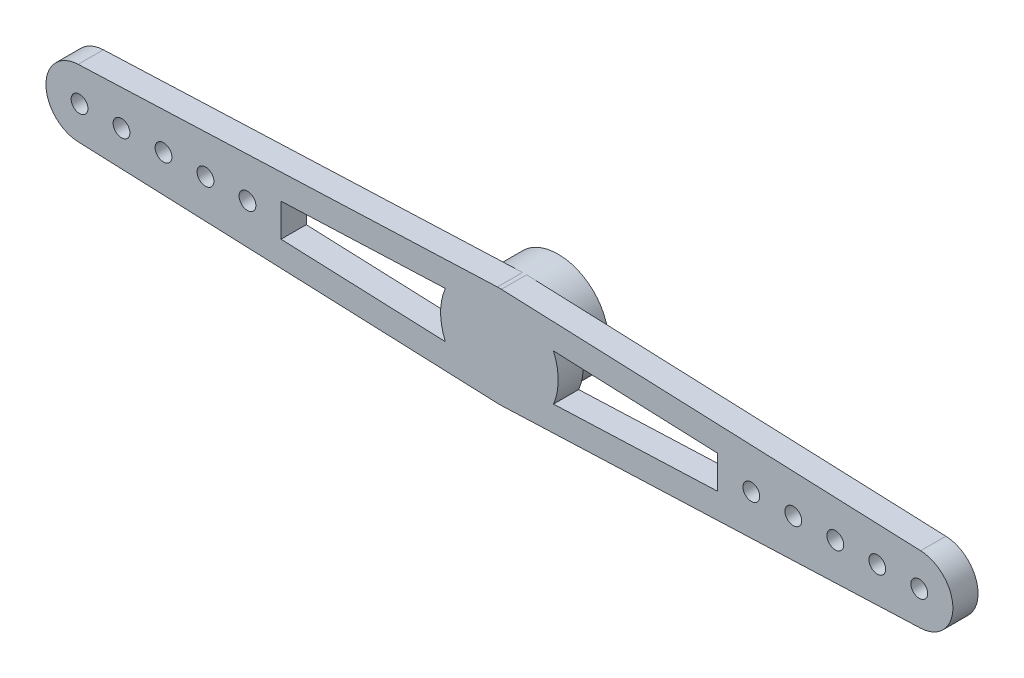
from build123d import *

# Parameters (mm, degrees)
ESQUISSE1_R           = 0.5
EXTRUSION6_DEPTH      = 1.5
EXTRUSION8_DEPTH      = 2
EXTRUSION8_DEPTH_BACK = 1.5
ESQUISSE3_R           = 3
ESQUISSE4_R           = 2
EXTRUSION9_DEPTH      = 2.5


with BuildPart() as part:
    # Esquisse1 → Extrusion6 (new body)
    with BuildSketch(Plane.XY):
        with BuildLine():
            Line((-25.08, 1.998399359), (-0.12, 2.997599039))
            ThreePointArc((-0.12, 2.997599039), (0, 3), (0.12, 2.997599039))
            Line((0.12, 2.997599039), (25.08, 1.998399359))
            ThreePointArc((25.08, 1.998399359), (27, 0), (25.08, -1.998399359))
            Line((25.08, -1.998399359), (0.12, -2.997599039))
            ThreePointArc((0.12, -2.997599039), (0, -3), (-0.12, -2.997599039))
            Line((-0.12, -2.997599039), (-25.08, -1.998399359))
            ThreePointArc((-25.08, -1.998399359), (-27, 0), (-25.08, 1.998399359))
        make_face()
        with Locations((-25, 0)):
            Circle(ESQUISSE1_R, mode=Mode.SUBTRACT)
        with Locations((-22.5, 0)):
            Circle(ESQUISSE1_R, mode=Mode.SUBTRACT)
        with Locations((-20, 0)):
            Circle(ESQUISSE1_R, mode=Mode.SUBTRACT)
        with Locations((20, 0)):
            Circle(ESQUISSE1_R, mode=Mode.SUBTRACT)
        with Locations((22.5, 0)):
            Circle(ESQUISSE1_R, mode=Mode.SUBTRACT)
        with Locations((25, 0)):
            Circle(ESQUISSE1_R, mode=Mode.SUBTRACT)
        with Locations((-17.5, 0)):
            Circle(ESQUISSE1_R, mode=Mode.SUBTRACT)
        with Locations((-15, 0)):
            Circle(ESQUISSE1_R, mode=Mode.SUBTRACT)
        with Locations((17.5, 0)):
            Circle(ESQUISSE1_R, mode=Mode.SUBTRACT)
        with Locations((15, 0)):
            Circle(ESQUISSE1_R, mode=Mode.SUBTRACT)
        with BuildLine():
            Line((-13, 0.980784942), (-3.219746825, 1.372308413))
            ThreePointArc((-3.219746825, 1.372308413), (-3.5, 0), (-3.219746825, -1.372308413))
            Line((-3.219746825, -1.372308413), (-13, -0.980784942))
            Line((-13, -0.980784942), (-13, 0.980784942))
        make_face(mode=Mode.SUBTRACT)
        with BuildLine():
            Line((3.219746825, 1.372308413), (13, 0.980784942))
            Line((13, 0.980784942), (13, -0.980784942))
            Line((13, -0.980784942), (3.219746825, -1.372308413))
            ThreePointArc((3.219746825, -1.372308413), (3.5, 0), (3.219746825, 1.372308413))
        make_face(mode=Mode.SUBTRACT)
    extrude(amount=EXTRUSION6_DEPTH)

    # Esquisse3 → Extrusion8 (add, two sides: drawn at the far end of the back side and taken through both)
    with BuildSketch(Plane(origin=(0, 0, 0), x_dir=(-1, 0, 0), z_dir=(0, 0, -1)).offset(-EXTRUSION8_DEPTH_BACK)):
        Circle(ESQUISSE3_R)
    extrude(amount=EXTRUSION8_DEPTH + EXTRUSION8_DEPTH_BACK)

    # Esquisse4 → Extrusion9 (cut)
    with BuildSketch(Plane(origin=(0, 0, -2), x_dir=(-1, 0, 0), z_dir=(0, 0, -1))):
        Circle(ESQUISSE4_R)
    extrude(amount=-EXTRUSION9_DEPTH, mode=Mode.SUBTRACT)


solid = part.part
